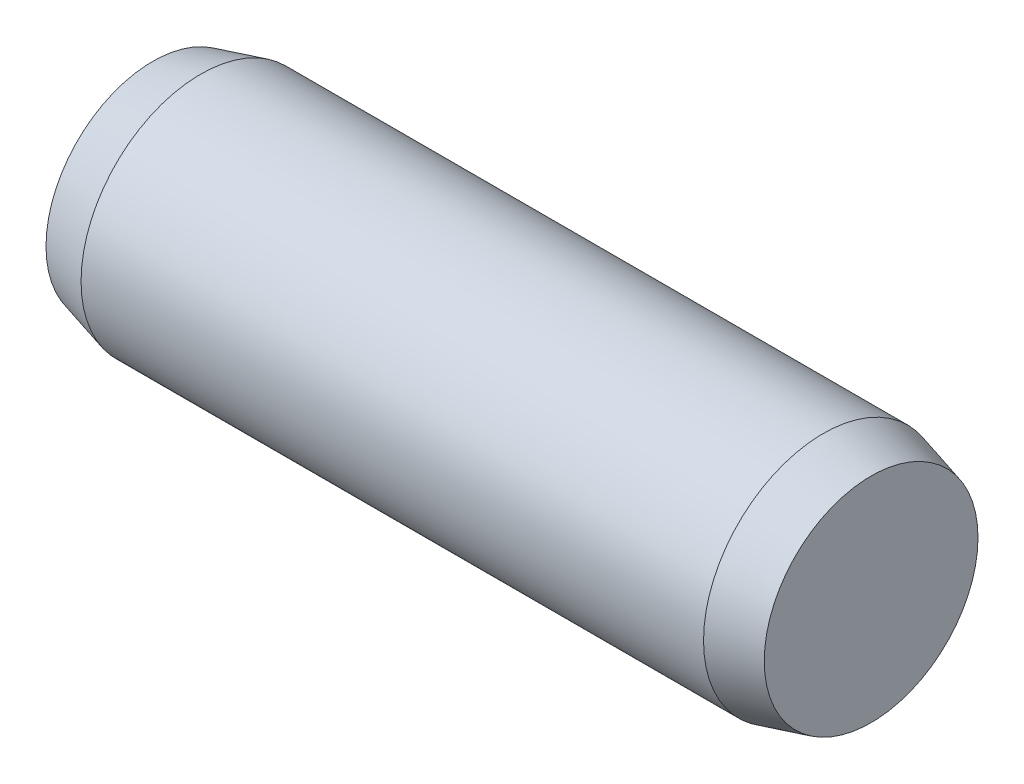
from build123d import *


with BuildPart() as part:
    # Sketch1 → Base-Revolve (revolve)
    with BuildSketch(Plane.XY, mode=Mode.PRIVATE) as base_revolve_sk:
        Polygon((0, 0), (3, 0), (3, 0.446410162), (2.8, 0.5), (0.2, 0.5), (0, 0.446410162), align=None)
    revolve(base_revolve_sk.sketch.rotate(Axis((-6.976683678, 0, 0), (1, 0, 0)), 90), axis=Axis((-6.976683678, 0, 0), (1, 0, 0)))


solid = part.part
